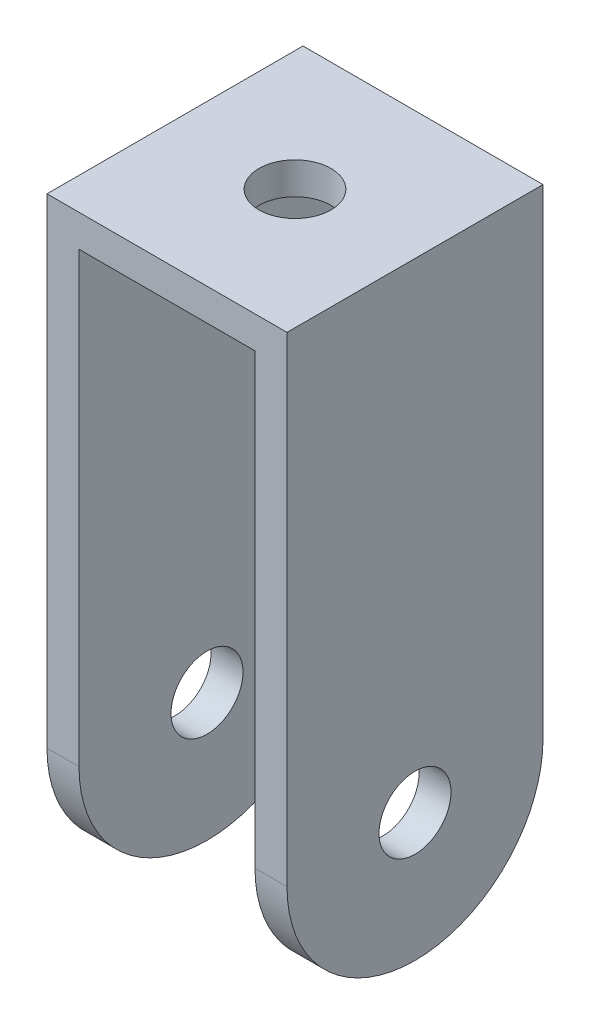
from build123d import *

# Parameters (mm, degrees)
EXTRUDE1_DEPTH = 16
SKETCH2_R      = 2.25
EXTRUDE2_DEPTH = 51.266875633
SKETCH3_R      = 2.25
EXTRUDE3_DEPTH = 16


with BuildPart() as part:
    # Sketch1 → Extrude1 (new body)
    with BuildSketch(Plane.XY):
        Polygon((0, 0), (0, 45.230065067), (15, 45.230065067), (15, 0), (13, 0), (13, 43.230065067), (2, 43.230065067), (2, 0), align=None)
    extrude(amount=EXTRUDE1_DEPTH)

    # Sketch2 → Extrude2 (cut, through all)
    with BuildSketch(Plane(origin=(0, 45.230065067, 0), x_dir=(1, 0, 0), z_dir=(0, 1, 0))):
        with Locations(Location((7.5, -8, 0), (0, 0, 270))):
            Circle(SKETCH2_R)
    extrude(amount=-EXTRUDE2_DEPTH, mode=Mode.SUBTRACT)

    # Sketch3 → Extrude3 (cut)
    with BuildSketch(Plane(origin=(15, 0, 0), x_dir=(0, 0, -1), z_dir=(1, 0, 0))):
        with Locations((-8, 15.230065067)):
            Circle(SKETCH3_R)
        with BuildLine():
            Line((0, 15.230065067), (0, 0))
            Line((0, 0), (-16, 0))
            Line((-16, 0), (-16, 15.230065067))
            ThreePointArc((-16, 15.230065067), (-8, 7.230065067), (0, 15.230065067))
        make_face()
    extrude(amount=-EXTRUDE3_DEPTH, mode=Mode.SUBTRACT)


solid = part.part
